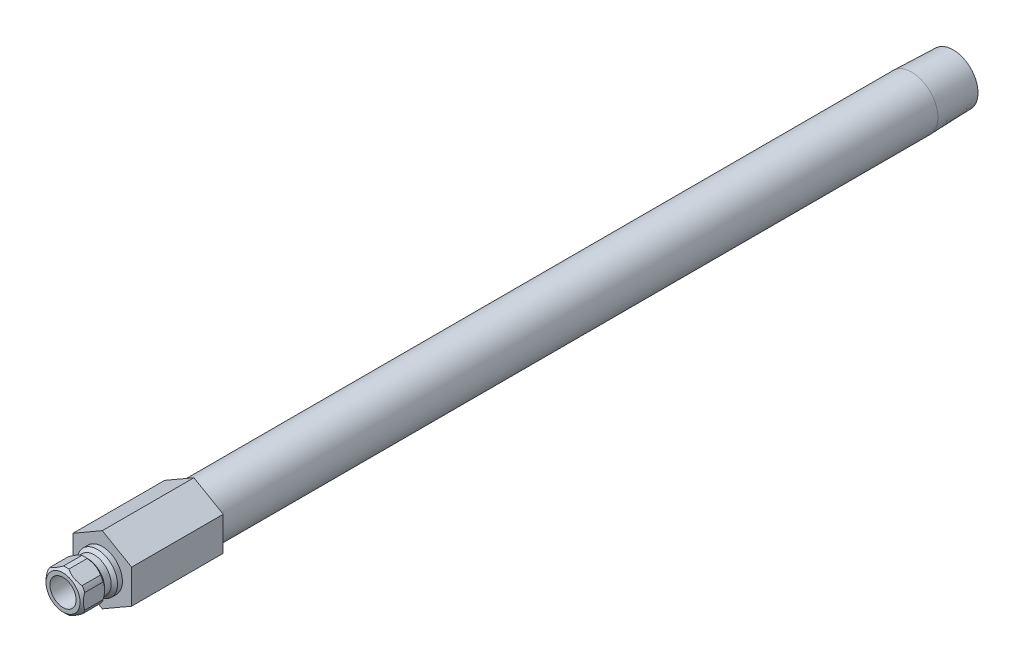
from build123d import *

# Parameters (mm, degrees)
SKETCH2_R           = 3.175
BOSS_EXTRUDE1_DEPTH = 22.225
CUT_EXTRUDE1_START  = 3.556
SKETCH3_OUTSIDE_W   = 59.622
SKETCH3_OUTSIDE_H   = 61.822
CUT_EXTRUDE1_DEPTH  = 204.104741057


with BuildPart() as part:
    # Sketch1 → Revolve1 (revolve)
    with BuildSketch(Plane(origin=(0, 0, 0), x_dir=(0, 0, -1), z_dir=(1, 0, 0))):
        Polygon((-9.525, 3.175), (-9.525, 4.1275), (-8.763, 4.8895), (-4.318, 4.8895), (-3.556, 4.1275), (-1.9685, 4.1275), (-1.2065, 4.8895), (0, 4.8895), (0, 6.35), (196.342, 6.35), (206.375, 6.036470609), (206.375, 4.6228), (22.225, 4.6228), (22.225, 3.175), align=None)
    revolve(axis=Axis((0, 0, 0), (0, 0, 1)))

    # Sketch2 → Boss-Extrude1 (add)
    with BuildSketch(Plane.XY):
        Polygon((-7.112, 4.106115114), (-7.112, -4.106115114), (0, -8.212230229), (7.112, -4.106115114), (7.112, 4.106115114), (0, 8.212230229), align=None)
        with Locations(Location((0, 0, 0), (0, 0, 90))):
            Circle(SKETCH2_R, mode=Mode.SUBTRACT)
    extrude(amount=-BOSS_EXTRUDE1_DEPTH)

    # Sketch3 outside → Cut-Extrude1 (cut, through all)
    with BuildSketch(Plane.XY.offset(CUT_EXTRUDE1_START)):
        Rectangle(SKETCH3_OUTSIDE_W, SKETCH3_OUTSIDE_H)
        Polygon((4.5212, -2.610316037), (4.5212, 2.610316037), (0, 5.220632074), (-4.5212, 2.610316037), (-4.5212, -2.610316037), (0, -5.220632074), align=None, mode=Mode.SUBTRACT)
    extrude(amount=CUT_EXTRUDE1_DEPTH, mode=Mode.SUBTRACT)


solid = part.part
